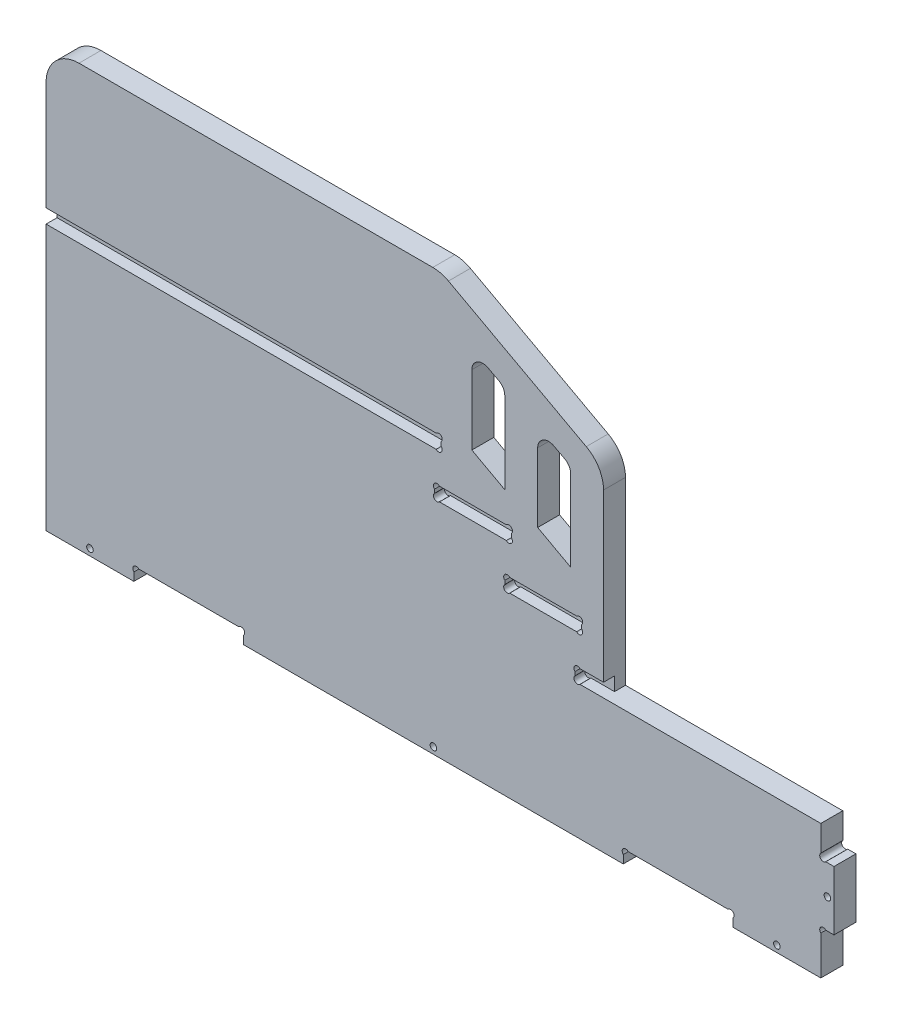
from build123d import *

# Parameters (mm, degrees)
BASE_EXTRUSION_DEPTH     = 10
ESQUISSE10_W             = 35
ESQUISSE10_H             = 6.2
ESQUISSE10_W_2           = 28
ENL_V_MAT_EXTRU_6_DEPTH  = 5
ESQUISSE9_W              = 180
ESQUISSE9_H              = 6.4
ENL_V_MAT_EXTRU_5_DEPTH  = 5
ENL_V_START              = -10
ESQUISSE5_W              = 50
ESQUISSE5_H              = 6
ENL_V_MAT_EXTRU_3_DEPTH  = 10
ENL_V_MAT_EXTRU_7_DEPTH  = 10
ESQUISSE8_W              = 10
ESQUISSE8_H              = 27
EXTRUSION2_DEPTH         = 6
ESQUISSE3_R              = 1.6
ENL_V_MAT_EXTRU_2_DEPTH  = 10
ESQUISSE6_R              = 1.5
ENL_V_MAT_EXTRU_4_DEPTH  = 10
ESQUISSE12_R             = 1.5
ENL_V_MAT_EXTRU_8_DEPTH  = 10
ESQUISSE13_R             = 1.6
ENL_V_MAT_EXTRU_9_DEPTH  = 5
CONG_1_R                 = 15
ENL_V_MAT_EXTRU_10_DEPTH = 10
CONG_2_R                 = 5


with BuildPart() as part:
    # Esquisse1 → Base-Extrusion (new body)
    with BuildSketch(Plane.XY):
        Polygon((294.761857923, -27.746666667), (210.761857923, -27.746666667), (210.761857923, -21.746666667), (210.761857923, 103.253333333), (-58.238142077, 103.253333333), (-58.238142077, 32.253333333), (-58.238142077, -88.746666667), (294.761857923, -88.746666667), align=None)
    extrude(amount=BASE_EXTRUSION_DEPTH)

    # Esquisse10 → Enl_v. mat.-Extru.6 (cut)
    with BuildSketch(Plane.XY.offset(10)):
        with Locations((168.261857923, -4.646666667)):
            Rectangle(ESQUISSE10_W, ESQUISSE10_H)
        with Locations((136.261857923, 15.353333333)):
            Rectangle(ESQUISSE10_W, ESQUISSE10_H)
        with Locations((196.761857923, -24.646666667)):
            Rectangle(ESQUISSE10_W_2, ESQUISSE10_H)
    extrude(amount=-ENL_V_MAT_EXTRU_6_DEPTH, mode=Mode.SUBTRACT)

    # Esquisse9 → Enl_v. mat.-Extru.5 (cut)
    with BuildSketch(Plane.XY.offset(10)):
        with Locations((31.761857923, 35.453333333)):
            Rectangle(ESQUISSE9_W, ESQUISSE9_H)
    extrude(amount=-ENL_V_MAT_EXTRU_5_DEPTH, mode=Mode.SUBTRACT)

    # Esquisse5 → Enl_v. mat.-Extru.3 (cut)
    with BuildSketch(Plane.XY.offset(10).offset(ENL_V_START)):
        with Locations((229.761857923, -85.746666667)):
            Rectangle(ESQUISSE5_W, ESQUISSE5_H)
        with Locations((6.761857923, -85.746666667)):
            Rectangle(ESQUISSE5_W, ESQUISSE5_H)
    extrude(amount=ENL_V_MAT_EXTRU_3_DEPTH, mode=Mode.SUBTRACT)

    # Esquisse11 → Enl_v. mat.-Extru.7 (cut)
    with BuildSketch(Plane.XY.offset(10).offset(ENL_V_START)):
        Polygon((210.761857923, -27.746666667), (195.761857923, -27.746666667), (195.761857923, 63.253333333), (121.761857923, 103.253333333), (210.761857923, 103.253333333), align=None)
    extrude(amount=ENL_V_MAT_EXTRU_7_DEPTH, mode=Mode.SUBTRACT)

    # Esquisse8 → Extrusion2 (add)
    with BuildSketch(Plane(origin=(294.761857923, 0, 0), x_dir=(0, 0, -1), z_dir=(1, 0, 0))):
        with Locations((-5, -55.246666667)):
            Rectangle(ESQUISSE8_W, ESQUISSE8_H)
    extrude(amount=EXTRUSION2_DEPTH)

    # Esquisse3 (on Front Plane) → Enl_v. mat.-Extru.2 (cut)
    with BuildSketch(Plane.XY):
        with Locations((253.661857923, -83.846666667)):
            Circle(ESQUISSE3_R)
        with Locations((205.861857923, -83.846666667)):
            Circle(ESQUISSE3_R)
        with Locations((30.661857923, -83.846666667)):
            Circle(ESQUISSE3_R)
        with Locations((-17.138142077, -83.846666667)):
            Circle(ESQUISSE3_R)
        with Locations((295.861857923, -40.646666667)):
            Circle(ESQUISSE3_R)
        with Locations((295.861857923, -69.846666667)):
            Circle(ESQUISSE3_R)
    extrude(amount=ENL_V_MAT_EXTRU_2_DEPTH, mode=Mode.SUBTRACT)

    # Esquisse6 → Enl_v. mat.-Extru.4 (cut)
    with BuildSketch(Plane.XY.offset(10).offset(ENL_V_START)):
        with Locations((-38.238142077, -85.746666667)):
            Circle(ESQUISSE6_R)
        with Locations((118.261857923, -85.746666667)):
            Circle(ESQUISSE6_R)
        with Locations((274.761857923, -85.746666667)):
            Circle(ESQUISSE6_R)
        with Locations((297.761857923, -55.246666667)):
            Circle(ESQUISSE6_R)
    extrude(amount=ENL_V_MAT_EXTRU_4_DEPTH, mode=Mode.SUBTRACT)

    # Esquisse12 → Enl_v. mat.-Extru.8 (cut)
    with BuildSketch(Plane.XY.offset(10)):
        with Locations((168.261857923, -4.646666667)):
            Circle(ESQUISSE12_R)
        with Locations((136.261857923, 15.353333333)):
            Circle(ESQUISSE12_R)
    extrude(amount=-ENL_V_MAT_EXTRU_8_DEPTH, mode=Mode.SUBTRACT)

    # Esquisse13 → Enl_v. mat.-Extru.9 (cut)
    with BuildSketch(Plane.XY.offset(10)):
        with Locations((183.861857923, -22.646666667)):
            Circle(ESQUISSE13_R)
        with Locations((183.861857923, -26.646666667)):
            Circle(ESQUISSE13_R)
        with Locations((184.661857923, -2.646666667)):
            Circle(ESQUISSE13_R)
        with Locations((184.661857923, -6.646666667)):
            Circle(ESQUISSE13_R)
        with Locations((151.861857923, -2.646666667)):
            Circle(ESQUISSE13_R)
        with Locations((151.861857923, -6.646666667)):
            Circle(ESQUISSE13_R)
        with Locations((152.661857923, 17.353333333)):
            Circle(ESQUISSE13_R)
        with Locations((152.661857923, 13.353333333)):
            Circle(ESQUISSE13_R)
        with Locations((119.861857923, 17.353333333)):
            Circle(ESQUISSE13_R)
        with Locations((119.861857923, 13.353333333)):
            Circle(ESQUISSE13_R)
        with Locations((120.661857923, 37.553333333)):
            Circle(ESQUISSE13_R)
        with Locations((120.661857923, 33.353333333)):
            Circle(ESQUISSE13_R)
    extrude(amount=-ENL_V_MAT_EXTRU_9_DEPTH, mode=Mode.SUBTRACT)

    # Cong_1
    cong_1_edges = [part.edges().sort_by_distance(p)[0] for p in [
        (195.761857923, 63.253333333, 5),
        (121.761857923, 103.253333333, 5),
        (-58.238142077, 103.253333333, 5),
    ]]
    fillet(cong_1_edges, radius=CONG_1_R)

    # Esquisse14 → Enl_v. mat.-Extru.10 (cut)
    with BuildSketch(Plane.XY.offset(10)):
        Polygon((180.761857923, 56.360296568), (165.761857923, 64.267259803), (165.761857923, 24.525790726), (180.761857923, 16.360296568), align=None)
        Polygon((135.761857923, 80.081186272), (150.761857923, 72.174223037), (150.761857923, 31.940620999), (135.761857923, 40.081186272), align=None)
    extrude(amount=-ENL_V_MAT_EXTRU_10_DEPTH, mode=Mode.SUBTRACT)

    # Cong_2
    cong_2_edges = [part.edges().sort_by_distance(p)[0] for p in [
        (180.761857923, 56.360296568, 5),
        (165.761857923, 64.267259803, 5),
        (135.761857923, 80.081186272, 5),
        (150.761857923, 72.174223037, 5),
    ]]
    fillet(cong_2_edges, radius=CONG_2_R)


solid = part.part
